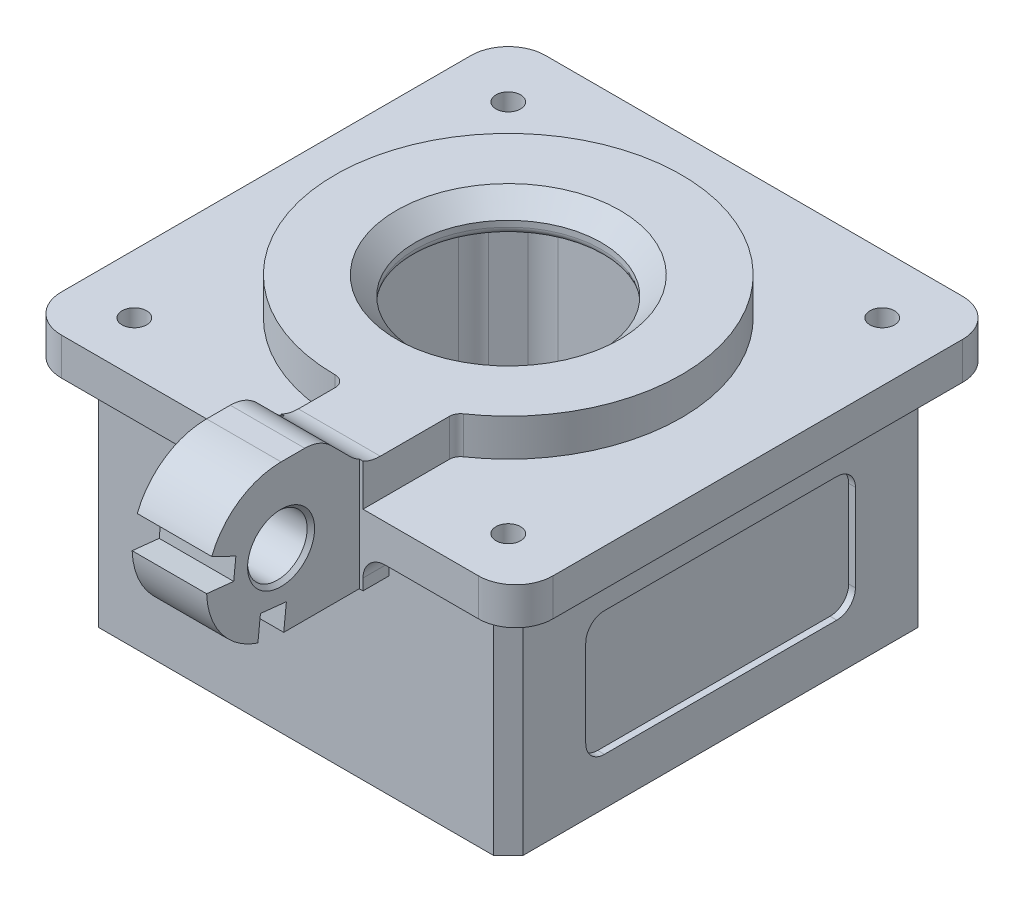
from build123d import *

# Parameters (mm, degrees)
EXTRUDE_START             = 14
SKETCH_1_W                = 66
SKETCH_1_H                = 66
EXTRUDE_1_DEPTH           = 40
SKETCH_2_R                = 12.5
CUT_EXTRUDE_1_DEPTH       = 62.465437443
SKETCH_4_W                = 47
SKETCH_4_H                = 47
CUT_EXTRUDE_3_DEPTH       = 32.7
SKETCH_9_W                = 66
SKETCH_9_H                = 66
SKETCH_9_W_2              = 57
SKETCH_9_H_2              = 57
CUT_EXTRUDE_5_DEPTH       = 30
HOLE_WIZARD_M41_D         = 3.3
HOLE_WIZARD_M41_DEPTH     = 11.5
HOLE_WIZARD_M41_TIP       = 0.991420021
CHAMFER_4_SIZE            = 5
FILLET_4_R                = 4
CHAMFER_5_SIZE            = 5
FILLET_5_R                = 4
CUT_EXTRUDE_9_DEPTH       = 2
HOLE_WIZARD_M2_51_D       = 2.05
HOLE_WIZARD_M2_51_DEPTH   = 7.25
HOLE_WIZARD_M2_51_TIP     = 0.615882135
CHAMFER_6_SIZE            = 2
CHAMFER_7_SIZE            = 2.5
SKETCH_29_W               = 66
SKETCH_29_H               = 66
SKETCH_29_R               = 23.25
CUT_EXTRUDE_15_DEPTH      = 5
SKETCH_30_W               = 66
SKETCH_30_H               = 1
CUT_EXTRUDE_16_DEPTH      = 59.335238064
FILLET_8_R                = 5
CUT_EXTRUDE_17_DEPTH      = 1.5
EXTRUDE_2_DEPTH           = 5.5
EXTRUDE_2_DEPTH_BACK      = 5.5
SKETCH_34_R               = 4
EXTRUDE_3_REACH           = 90.28
SKETCH_35_W               = 11
SKETCH_35_H               = 5
FILLET_9_R                = 1.5
FILLET_10_R               = 3
FILLET_11_R               = 5
CHAMFER_8_SIZE            = 0.5
CUT_EXTRUDE_18_DEPTH      = 10
CUT_EXTRUDE_18_DEPTH_BACK = 92.469940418
SKETCH_39_R               = 17.5
CUT_EXTRUDE_20_DEPTH      = 3
SKETCH_40_R               = 17.5
SKETCH_40_R_2             = 16
CUT_EXTRUDE_21_DEPTH      = 0.5
FILLET_12_R               = 1
HOLE_WIZARD_M32_D         = 2.5
HOLE_WIZARD_M32_DEPTH     = 6
HOLE_WIZARD_M32_TIP       = 0.751075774
CUT_EXTRUDE_22_DEPTH      = 92.466796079
SKETCH_47_W               = 5.203362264
SKETCH_47_H               = 23.668372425
SKETCH_47_W_2             = 5.759025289
CUT_EXTRUDE_23_DEPTH      = 77.908548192
CHAMFER_9_SIZE            = 0.5
CUT_EXTRUDE_24_DEPTH      = 0.9


with BuildPart() as part:
    # Sketch 1 → Extrude 1 (new body)
    with BuildSketch(Plane(origin=(0, 0, 0), x_dir=(1, 0, 0), z_dir=(0, 1, 0)).offset(EXTRUDE_START)):
        Rectangle(SKETCH_1_W, SKETCH_1_H)
    extrude(amount=EXTRUDE_1_DEPTH)

    # Sketch 2 → Cut-Extrude 1 (cut, through all)
    with BuildSketch(Plane(origin=(0, 54, 0), x_dir=(1, 0, 0), z_dir=(0, 1, 0))):
        with Locations(Location((0, 0, 0), (0, 0, 270))):
            Circle(SKETCH_2_R)
    extrude(amount=-CUT_EXTRUDE_1_DEPTH, mode=Mode.SUBTRACT)

    # Sketch 4 → Cut-Extrude 3 (cut)
    with BuildSketch(Plane.XZ.offset(-14)):
        Rectangle(SKETCH_4_W, SKETCH_4_H)
    extrude(amount=-CUT_EXTRUDE_3_DEPTH, mode=Mode.SUBTRACT)

    # Sketch 9 → Cut-Extrude 5 (cut)
    with BuildSketch(Plane.XZ.offset(-14)):
        Rectangle(SKETCH_9_W, SKETCH_9_H)
        Rectangle(SKETCH_9_W_2, SKETCH_9_H_2, mode=Mode.SUBTRACT)
    extrude(amount=-CUT_EXTRUDE_5_DEPTH, mode=Mode.SUBTRACT)

    # Hole Wizard M41
    with Locations(Plane(origin=(0, 54, 0), x_dir=(1, 0, 0), z_dir=(0, 1, 0))):
        with Locations((-25.102290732, 25.102290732), (25.102290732, 25.102290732), (-25.102290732, -25.102290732), (25.102290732, -25.102290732)):
            Hole(HOLE_WIZARD_M41_D / 2, depth=HOLE_WIZARD_M41_DEPTH)
            with Locations((0, 0, -(HOLE_WIZARD_M41_DEPTH + HOLE_WIZARD_M41_TIP / 2))):  # 118° drill point
                Cone(0, HOLE_WIZARD_M41_D / 2, HOLE_WIZARD_M41_TIP, mode=Mode.SUBTRACT)

    # Chamfer 4
    chamfer_4_edges = [part.edges().sort_by_distance(p)[0] for p in [
        (23.5, 30.35, -23.5),
    ]]
    chamfer(chamfer_4_edges, length=CHAMFER_4_SIZE)

    # Fillet 4
    fillet_4_edges = [part.edges().sort_by_distance(p)[0] for p in [
        (23.5, 30.35, -18.5),
        (18.5, 30.35, -23.5),
    ]]
    fillet(fillet_4_edges, radius=FILLET_4_R)

    # Chamfer 5
    chamfer_5_edges = [part.edges().sort_by_distance(p)[0] for p in [
        (23.5, 30.35, 23.5),
        (-23.5, 30.35, -23.5),
        (-23.5, 30.35, 23.5),
    ]]
    chamfer(chamfer_5_edges, length=CHAMFER_5_SIZE)

    # Fillet 5
    fillet_5_edges = [part.edges().sort_by_distance(p)[0] for p in [
        (18.5, 30.35, 23.5),
        (-18.5, 30.35, 23.5),
        (23.5, 30.35, 18.5),
        (-18.5, 30.35, -23.5),
        (-23.5, 30.35, -18.5),
        (-23.5, 30.35, 18.5),
    ]]
    fillet(fillet_5_edges, radius=FILLET_5_R)

    # Sketch 19 → Cut-Extrude 9 (cut)
    with BuildSketch(Plane.XZ.offset(-14)):
        with BuildLine():
            Line((-27.5, 24.5), (-27.5, -24.5))
            ThreePointArc((-27.5, -24.5), (-26.621320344, -26.621320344), (-24.5, -27.5))
            Line((-24.5, -27.5), (24.5, -27.5))
            ThreePointArc((24.5, -27.5), (26.621320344, -26.621320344), (27.5, -24.5))
            Line((27.5, -24.5), (27.5, 24.5))
            ThreePointArc((27.5, 24.5), (26.621320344, 26.621320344), (24.5, 27.5))
            Line((24.5, 27.5), (-24.5, 27.5))
            ThreePointArc((-24.5, 27.5), (-26.621320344, 26.621320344), (-27.5, 24.5))
        make_face()
    extrude(amount=-CUT_EXTRUDE_9_DEPTH, mode=Mode.SUBTRACT)

    # Hole Wizard M2.51
    with Locations(Plane(origin=(0, 16, 0), x_dir=(-1, 0, 0), z_dir=(0, -1, 0))):
        with Locations((25, -25), (25, 25), (-25, 25), (-25, -25)):
            Hole(HOLE_WIZARD_M2_51_D / 2, depth=HOLE_WIZARD_M2_51_DEPTH)
            with Locations((0, 0, -(HOLE_WIZARD_M2_51_DEPTH + HOLE_WIZARD_M2_51_TIP / 2))):  # 118° drill point
                Cone(0, HOLE_WIZARD_M2_51_D / 2, HOLE_WIZARD_M2_51_TIP, mode=Mode.SUBTRACT)

    # Chamfer 6
    chamfer_6_edges = [part.edges().sort_by_distance(p)[0] for p in [
        (28.5, 29, -28.5),
        (-28.5, 29, -28.5),
        (-28.5, 29, 28.5),
        (28.5, 29, 28.5),
    ]]
    chamfer(chamfer_6_edges, length=CHAMFER_6_SIZE)

    # Chamfer 7
    chamfer_7_edges = [part.edges().sort_by_distance(p)[0] for p in [
        (0, 54, -12.5),
    ]]
    chamfer(chamfer_7_edges, length=CHAMFER_7_SIZE)

    # Sketch 29 → Cut-Extrude 15 (cut)
    with BuildSketch(Plane(origin=(0, 54, 0), x_dir=(1, 0, 0), z_dir=(0, 1, 0))):
        Rectangle(SKETCH_29_W, SKETCH_29_H)
        with Locations(Location((0, 0, 0), (0, 0, 270))):
            Circle(SKETCH_29_R, mode=Mode.SUBTRACT)
    extrude(amount=-CUT_EXTRUDE_15_DEPTH, mode=Mode.SUBTRACT)

    # Sketch 30 → Cut-Extrude 16 (cut, through all)
    with BuildSketch(Plane(origin=(0, 49, 0), x_dir=(1, 0, 0), z_dir=(0, 1, 0))):
        with Locations((0, -32.5)):
            Rectangle(SKETCH_30_W, SKETCH_30_H)
    extrude(amount=-CUT_EXTRUDE_16_DEPTH, mode=Mode.SUBTRACT)

    # Fillet 8
    fillet_8_edges = [part.edges().sort_by_distance(p)[0] for p in [
        (-33, 46.5, -33),
        (33, 46.5, -33),
        (-33, 46.5, 32),
        (33, 46.5, 32),
    ]]
    fillet(fillet_8_edges, radius=FILLET_8_R)

    # Sketch 31 → Cut-Extrude 17 (cut)
    with BuildSketch(Plane.XZ.offset(-16)):
        with BuildLine():
            Line((26.5, -16.843145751), (26.5, 16.843145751))
            ThreePointArc((26.5, 16.843145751), (25.967156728, 19.521929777), (24.449747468, 21.792893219))
            Line((24.449747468, 21.792893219), (21.792893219, 24.449747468))
            ThreePointArc((21.792893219, 24.449747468), (19.521929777, 25.967156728), (16.843145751, 26.5))
            Line((16.843145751, 26.5), (-16.843145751, 26.5))
            ThreePointArc((-16.843145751, 26.5), (-19.521929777, 25.967156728), (-21.792893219, 24.449747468))
            Line((-21.792893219, 24.449747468), (-24.449747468, 21.792893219))
            ThreePointArc((-24.449747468, 21.792893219), (-25.967156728, 19.521929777), (-26.5, 16.843145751))
            Line((-26.5, 16.843145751), (-26.5, -16.843145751))
            ThreePointArc((-26.5, -16.843145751), (-25.967156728, -19.521929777), (-24.449747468, -21.792893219))
            Line((-24.449747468, -21.792893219), (-21.792893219, -24.449747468))
            ThreePointArc((-21.792893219, -24.449747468), (-19.521929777, -25.967156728), (-16.843145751, -26.5))
            Line((-16.843145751, -26.5), (16.843145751, -26.5))
            ThreePointArc((16.843145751, -26.5), (19.521929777, -25.967156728), (21.792893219, -24.449747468))
            Line((21.792893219, -24.449747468), (24.449747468, -21.792893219))
            ThreePointArc((24.449747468, -21.792893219), (25.967156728, -19.521929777), (26.5, -16.843145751))
        make_face()
        with BuildLine():
            Line((24.5, -16.843145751), (24.5, 16.843145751))
            ThreePointArc((24.5, 16.843145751), (24.119397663, 18.756562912), (23.035533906, 20.378679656))
            Line((23.035533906, 20.378679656), (20.378679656, 23.035533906))
            ThreePointArc((20.378679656, 23.035533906), (18.756562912, 24.119397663), (16.843145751, 24.5))
            Line((16.843145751, 24.5), (-16.843145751, 24.5))
            ThreePointArc((-16.843145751, 24.5), (-18.756562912, 24.119397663), (-20.378679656, 23.035533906))
            Line((-20.378679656, 23.035533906), (-23.035533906, 20.378679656))
            ThreePointArc((-23.035533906, 20.378679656), (-24.119397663, 18.756562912), (-24.5, 16.843145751))
            Line((-24.5, 16.843145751), (-24.5, -16.843145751))
            ThreePointArc((-24.5, -16.843145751), (-24.119397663, -18.756562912), (-23.035533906, -20.378679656))
            Line((-23.035533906, -20.378679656), (-20.378679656, -23.035533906))
            ThreePointArc((-20.378679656, -23.035533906), (-18.756562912, -24.119397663), (-16.843145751, -24.5))
            Line((-16.843145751, -24.5), (16.843145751, -24.5))
            ThreePointArc((16.843145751, -24.5), (18.756562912, -24.119397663), (20.378679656, -23.035533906))
            Line((20.378679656, -23.035533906), (23.035533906, -20.378679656))
            ThreePointArc((23.035533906, -20.378679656), (24.119397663, -18.756562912), (24.5, -16.843145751))
        make_face(mode=Mode.SUBTRACT)
    extrude(amount=-CUT_EXTRUDE_17_DEPTH, mode=Mode.SUBTRACT)

    # Sketch 34 → Extrude 2 (add, two sides: drawn at the far end of the back side and taken through both)
    with BuildSketch(Plane(origin=(7, 0, 0), x_dir=(0, 0, -1), z_dir=(1, 0, 0)).offset(-EXTRUDE_2_DEPTH_BACK)):
        with BuildLine():
            Line((-23.25, 54), (-31.75, 54))
            Line((-31.75, 54), (-37.25, 59.5))
            Line((-37.25, 59.5), (-42.5, 59.5))
            ThreePointArc((-42.5, 59.5), (-52.5, 49.5), (-42.5, 39.5))
            Line((-42.5, 39.5), (-28.5, 39.5))
            Line((-28.5, 39.5), (-28.5, 44))
            Line((-28.5, 44), (-32, 44))
            Line((-32, 44), (-32, 49))
            Line((-32, 49), (-23.25, 49))
            Line((-23.25, 49), (-23.25, 54))
        make_face()
        with Locations((-42.5, 49.5)):
            Circle(SKETCH_34_R, mode=Mode.SUBTRACT)
    extrude(amount=EXTRUDE_2_DEPTH + EXTRUDE_2_DEPTH_BACK)

    # Sketch 35 → Extrude 3 (add, up to next)
    with BuildSketch(Plane(origin=(0, 0, 23.25), x_dir=(-1, 0, 0), z_dir=(0, 0, -1)), mode=Mode.PRIVATE) as extrude_3_sk1:
        with Locations((-7, 51.5)):
            Rectangle(SKETCH_35_W, SKETCH_35_H)
    extrude_3_tool1 = extrude(extrude_3_sk1.sketch, amount=EXTRUDE_3_REACH, mode=Mode.PRIVATE) - part.part
    add(extrude_3_tool1.solids().sort_by_distance((7, 51.5, 23.25))[0])

    # Fillet 9
    fillet_9_edges = [part.edges().sort_by_distance(p)[0] for p in [
        (1.5, 51.5, 23.201562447),
        (12.5, 51.5, 19.60388992),
    ]]
    fillet(fillet_9_edges, radius=FILLET_9_R)

    # Fillet 10
    fillet_10_edges = [part.edges().sort_by_distance(p)[0] for p in [
        (1.5, 44, 30.25),
        (12.5, 44, 30.25),
    ]]
    fillet(fillet_10_edges, radius=FILLET_10_R)

    # Fillet 11
    fillet_11_edges = [part.edges().sort_by_distance(p)[0] for p in [
        (7, 59.5, 37.25),
        (7, 54, 31.75),
    ]]
    fillet(fillet_11_edges, radius=FILLET_11_R)

    # Chamfer 8
    chamfer_8_edges = [part.edges().sort_by_distance(p)[0] for p in [
        (1.5, 49.5, 46.5),
        (12.5, 49.5, 46.5),
    ]]
    chamfer(chamfer_8_edges, length=CHAMFER_8_SIZE)

    # Sketch 36 → Cut-Extrude 18 (cut, two sides: drawn at the far end of the back side and taken through both)
    with BuildSketch(Plane(origin=(12.5, 0, 0), x_dir=(0, 0, -1), z_dir=(1, 0, 0)).offset(-CUT_EXTRUDE_18_DEPTH_BACK)):
        with BuildLine():
            Line((-51.824304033, 53.159945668), (-48.568052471, 51.571765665))
            Line((-48.568052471, 51.571765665), (-48.860732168, 48.787104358))
            Line((-48.860732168, 48.787104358), (-52.494655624, 49.169045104))
            ThreePointArc((-52.494655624, 49.169045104), (-52.358393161, 51.197906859), (-51.824304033, 53.159945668))
        make_face()
    extrude(amount=CUT_EXTRUDE_18_DEPTH + CUT_EXTRUDE_18_DEPTH_BACK, mode=Mode.SUBTRACT)

    # Sketch 39 → Cut-Extrude 20 (cut)
    with BuildSketch(Plane.XZ.offset(-46.7)):
        with Locations(Location((0, 0, 0), (0, 0, 270))):
            Circle(SKETCH_39_R)
    extrude(amount=-CUT_EXTRUDE_20_DEPTH, mode=Mode.SUBTRACT)

    # Sketch 40 → Cut-Extrude 21 (cut)
    with BuildSketch(Plane.XZ.offset(-49.7)):
        with Locations(Location((0, 0, 0), (0, 0, 270))):
            Circle(SKETCH_40_R)
        with Locations(Location((0, 0, 0), (0, 0, 270))):
            Circle(SKETCH_40_R_2, mode=Mode.SUBTRACT)
    extrude(amount=-CUT_EXTRUDE_21_DEPTH, mode=Mode.SUBTRACT)

    # Fillet 12
    fillet_12_edges = [part.edges().sort_by_distance(p)[0] for p in [
        (0, 49.7, -12.5),
    ]]
    fillet(fillet_12_edges, radius=FILLET_12_R)

    # Hole Wizard M32
    with Locations(Plane(origin=(0, 46.7, 0), x_dir=(-1, 0, 0), z_dir=(0, -1, 0))):
        with Locations((20, 0), (0, -20), (-20, 0), (0, 20)):
            Hole(HOLE_WIZARD_M32_D / 2, depth=HOLE_WIZARD_M32_DEPTH)
            with Locations((0, 0, -(HOLE_WIZARD_M32_DEPTH + HOLE_WIZARD_M32_TIP / 2))):  # 118° drill point
                Cone(0, HOLE_WIZARD_M32_D / 2, HOLE_WIZARD_M32_TIP, mode=Mode.SUBTRACT)

    # Sketch 46 → Cut-Extrude 22 (cut, through all)
    with BuildSketch(Plane(origin=(12.5, 0, 0), x_dir=(0, 0, -1), z_dir=(1, 0, 0))):
        with BuildLine():
            Line((-42.143330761, 39.5), (-41.787104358, 42.889267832))
            Line((-41.787104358, 42.889267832), (-45.267930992, 43.255117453))
            Line((-45.267930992, 43.255117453), (-45.610472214, 39.996055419))
            ThreePointArc((-45.610472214, 39.996055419), (-44.07488955, 39.624792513), (-42.5, 39.5))
            Line((-42.5, 39.5), (-42.143330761, 39.5))
        make_face()
    extrude(amount=-CUT_EXTRUDE_22_DEPTH, mode=Mode.SUBTRACT)

    # Sketch 47 → Cut-Extrude 23 (cut, through all)
    with BuildSketch(Plane(origin=(0, 59.5, 0), x_dir=(1, 0, 0), z_dir=(0, 1, 0))):
        with Locations((-0.601681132, -43.834186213)):
            Rectangle(SKETCH_47_W, SKETCH_47_H)
        with Locations((14.879512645, -43.834186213)):
            Rectangle(SKETCH_47_W_2, SKETCH_47_H)
    extrude(amount=-CUT_EXTRUDE_23_DEPTH, mode=Mode.SUBTRACT)

    # Chamfer 9
    chamfer_9_edges = [part.edges().sort_by_distance(p)[0] for p in [
        (2, 49.5, 46.5),
        (12, 49.5, 46.5),
    ]]
    chamfer(chamfer_9_edges, length=CHAMFER_9_SIZE)

    # Sketch 48 → Cut-Extrude 24 (cut)
    with BuildSketch(Plane(origin=(28.5, 0, 0), x_dir=(0, 0, -1), z_dir=(1, 0, 0))):
        with BuildLine():
            Line((-15.6, 20.3), (15.6, 20.3))
            ThreePointArc((15.6, 20.3), (17.367766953, 21.032233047), (18.1, 22.8))
            Line((18.1, 22.8), (18.1, 34.5))
            ThreePointArc((18.1, 34.5), (17.367766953, 36.267766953), (15.6, 37))
            Line((15.6, 37), (-15.6, 37))
            ThreePointArc((-15.6, 37), (-17.367766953, 36.267766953), (-18.1, 34.5))
            Line((-18.1, 34.5), (-18.1, 22.8))
            ThreePointArc((-18.1, 22.8), (-17.367766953, 21.032233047), (-15.6, 20.3))
        make_face()
    extrude(amount=-CUT_EXTRUDE_24_DEPTH, mode=Mode.SUBTRACT)


solid = part.part
